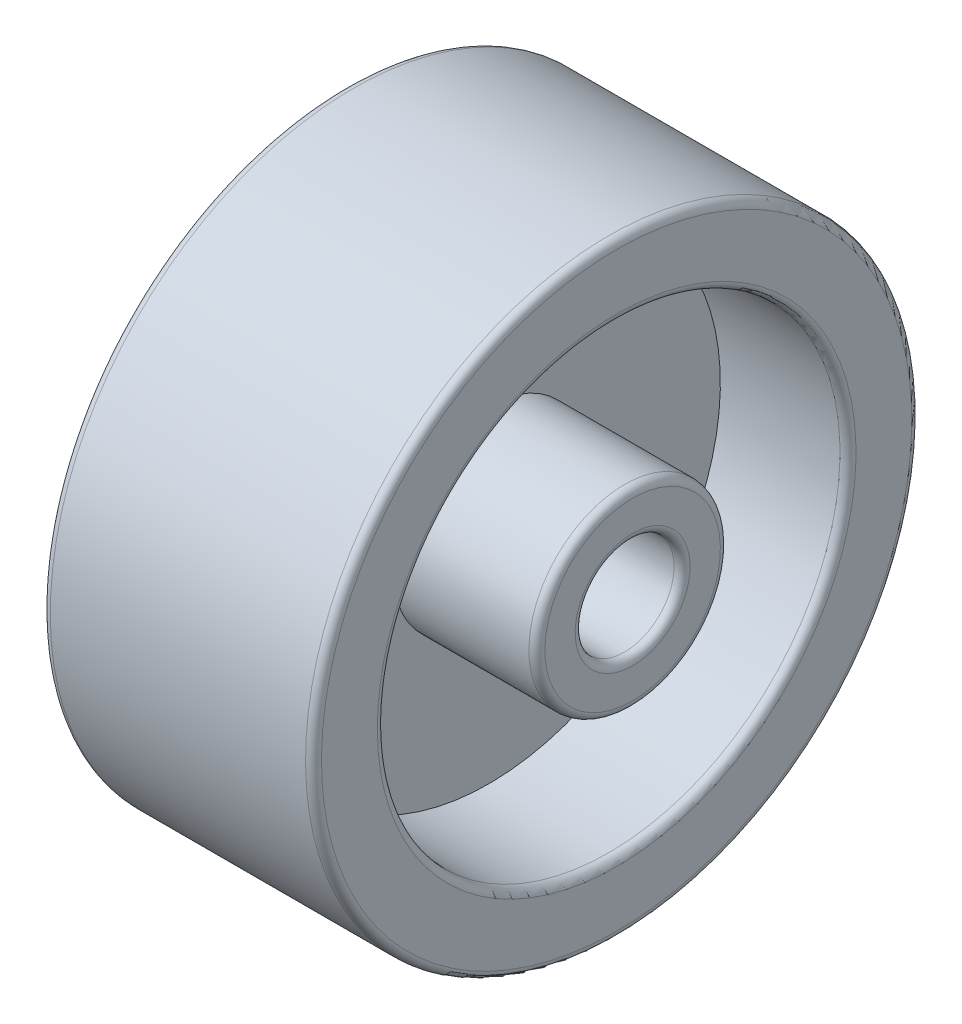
ISO-10303-21;
HEADER;
FILE_DESCRIPTION(('STEP AP214'),'2;1');
FILE_NAME('part.step','',(''),(''),'','','');
FILE_SCHEMA(('AUTOMOTIVE_DESIGN { 1 0 10303 214 1 1 1 1 }'));
ENDSEC;
DATA;
#1=APPLICATION_CONTEXT('core data for automotive mechanical design processes');
#2=APPLICATION_PROTOCOL_DEFINITION('international standard','automotive_design',2000,#1);
#3=PRODUCT_CONTEXT('',#1,'mechanical');
#4=PRODUCT('Part','Part','',(#3));
#5=PRODUCT_RELATED_PRODUCT_CATEGORY('part','',(#4));
#6=PRODUCT_DEFINITION_FORMATION('','',#4);
#7=PRODUCT_DEFINITION_CONTEXT('part definition',#1,'design');
#8=PRODUCT_DEFINITION('design','',#6,#7);
#9=PRODUCT_DEFINITION_SHAPE('','',#8);
#10=(LENGTH_UNIT() NAMED_UNIT(*) SI_UNIT(.MILLI.,.METRE.));
#11=(NAMED_UNIT(*) PLANE_ANGLE_UNIT() SI_UNIT($,.RADIAN.));
#12=(NAMED_UNIT(*) SI_UNIT($,.STERADIAN.) SOLID_ANGLE_UNIT());
#13=UNCERTAINTY_MEASURE_WITH_UNIT(LENGTH_MEASURE(1.E-05),#10,'distance_accuracy_value','');
#14=(GEOMETRIC_REPRESENTATION_CONTEXT(3) GLOBAL_UNCERTAINTY_ASSIGNED_CONTEXT((#13)) GLOBAL_UNIT_ASSIGNED_CONTEXT((#10,
#11,#12)) REPRESENTATION_CONTEXT('',''));
#15=CARTESIAN_POINT('',(0.,0.,0.));
#16=DIRECTION('',(0.,0.,1.));
#17=DIRECTION('',(1.,0.,0.));
#18=AXIS2_PLACEMENT_3D('',#15,#16,#17);
#19=CARTESIAN_POINT('',(-266.908011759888,1159.35472436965,32.));
#20=DIRECTION('',(1.,0.,0.));
#21=DIRECTION('',(0.,-0.55664943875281,-0.830747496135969));
#22=AXIS2_PLACEMENT_3D('',#19,#20,#21);
#23=TOROIDAL_SURFACE('',#22,18.5,0.5);
#24=CARTESIAN_POINT('',(-266.408011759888,1159.35472436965,32.));
#25=DIRECTION('',(1.,0.,0.));
#26=DIRECTION('',(0.,-0.55664943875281,-0.830747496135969));
#27=AXIS2_PLACEMENT_3D('',#24,#25,#26);
#28=CIRCLE('',#27,18.5);
#29=CARTESIAN_POINT('',(-266.408011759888,1149.05670975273,16.6311713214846));
#30=VERTEX_POINT('',#29);
#31=EDGE_CURVE('E78',#30,#30,#28,.T.);
#32=ORIENTED_EDGE('',*,*,#31,.F.);
#33=EDGE_LOOP('',(#32));
#34=FACE_BOUND('',#33,.T.);
#35=CARTESIAN_POINT('',(-266.908011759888,1159.35472436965,32.));
#36=DIRECTION('',(1.,0.,0.));
#37=DIRECTION('',(0.,-0.55664943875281,-0.830747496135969));
#38=AXIS2_PLACEMENT_3D('',#35,#36,#37);
#39=CIRCLE('',#38,19.);
#40=CARTESIAN_POINT('',(-266.908011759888,1148.77838503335,16.2157975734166));
#41=VERTEX_POINT('',#40);
#42=EDGE_CURVE('E10',#41,#41,#39,.T.);
#43=ORIENTED_EDGE('',*,*,#42,.T.);
#44=EDGE_LOOP('',(#43));
#45=FACE_BOUND('',#44,.T.);
#46=ADVANCED_FACE('F14',(#34,#45),#23,.T.);
#47=CARTESIAN_POINT('',(-162.602134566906,1159.35472436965,32.));
#48=DIRECTION('',(1.,0.,0.));
#49=DIRECTION('',(0.,-0.55664943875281,-0.830747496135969));
#50=AXIS2_PLACEMENT_3D('',#47,#48,#49);
#51=CYLINDRICAL_SURFACE('',#50,19.);
#52=ORIENTED_EDGE('',*,*,#42,.F.);
#53=EDGE_LOOP('',(#52));
#54=FACE_BOUND('',#53,.T.);
#55=CARTESIAN_POINT('',(-282.908011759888,1159.35472436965,32.));
#56=DIRECTION('',(1.,0.,0.));
#57=DIRECTION('',(0.,-0.55664943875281,-0.830747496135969));
#58=AXIS2_PLACEMENT_3D('',#55,#56,#57);
#59=CIRCLE('',#58,19.);
#60=CARTESIAN_POINT('',(-282.908011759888,1148.77838503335,16.2157975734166));
#61=VERTEX_POINT('',#60);
#62=EDGE_CURVE('E20',#61,#61,#59,.T.);
#63=ORIENTED_EDGE('',*,*,#62,.T.);
#64=EDGE_LOOP('',(#63));
#65=FACE_BOUND('',#64,.T.);
#66=ADVANCED_FACE('F85',(#54,#65),#51,.T.);
#67=CARTESIAN_POINT('',(-282.908011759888,1159.35472436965,32.));
#68=DIRECTION('',(1.,0.,0.));
#69=DIRECTION('',(0.,-0.55664943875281,-0.830747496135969));
#70=AXIS2_PLACEMENT_3D('',#67,#68,#69);
#71=TOROIDAL_SURFACE('',#70,18.5,0.5);
#72=ORIENTED_EDGE('',*,*,#62,.F.);
#73=EDGE_LOOP('',(#72));
#74=FACE_BOUND('',#73,.T.);
#75=CARTESIAN_POINT('',(-283.408011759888,1159.35472436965,32.));
#76=DIRECTION('',(1.,0.,0.));
#77=DIRECTION('',(0.,-0.55664943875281,-0.830747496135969));
#78=AXIS2_PLACEMENT_3D('',#75,#76,#77);
#79=CIRCLE('',#78,18.5);
#80=CARTESIAN_POINT('',(-283.408011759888,1149.05670975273,16.6311713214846));
#81=VERTEX_POINT('',#80);
#82=EDGE_CURVE('E24',#81,#81,#79,.T.);
#83=ORIENTED_EDGE('',*,*,#82,.T.);
#84=EDGE_LOOP('',(#83));
#85=FACE_BOUND('',#84,.T.);
#86=ADVANCED_FACE('F91',(#74,#85),#71,.T.);
#87=CARTESIAN_POINT('',(-283.408011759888,1174.72355304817,21.7019853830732));
#88=DIRECTION('',(1.,0.,0.));
#89=DIRECTION('',(0.,-0.55664943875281,-0.830747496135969));
#90=AXIS2_PLACEMENT_3D('',#87,#88,#89);
#91=PLANE('',#90);
#92=ORIENTED_EDGE('',*,*,#82,.F.);
#93=EDGE_LOOP('',(#92));
#94=FACE_BOUND('',#93,.T.);
#95=CARTESIAN_POINT('',(-283.408011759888,1159.35472436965,32.));
#96=DIRECTION('',(1.,0.,0.));
#97=DIRECTION('',(0.,-0.55664943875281,-0.830747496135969));
#98=AXIS2_PLACEMENT_3D('',#95,#96,#97);
#99=CIRCLE('',#98,15.);
#100=CARTESIAN_POINT('',(-283.408011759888,1151.00498278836,19.5387875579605));
#101=VERTEX_POINT('',#100);
#102=EDGE_CURVE('E28',#101,#101,#99,.T.);
#103=ORIENTED_EDGE('',*,*,#102,.T.);
#104=EDGE_LOOP('',(#103));
#105=FACE_BOUND('',#104,.T.);
#106=ADVANCED_FACE('F97',(#94,#105),#91,.F.);
#107=CARTESIAN_POINT('',(-282.908011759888,1159.35472436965,32.));
#108=DIRECTION('',(1.,0.,0.));
#109=DIRECTION('',(0.,-0.55664943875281,-0.830747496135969));
#110=AXIS2_PLACEMENT_3D('',#107,#108,#109);
#111=TOROIDAL_SURFACE('',#110,15.,0.5);
#112=ORIENTED_EDGE('',*,*,#102,.F.);
#113=EDGE_LOOP('',(#112));
#114=FACE_BOUND('',#113,.T.);
#115=CARTESIAN_POINT('',(-282.908011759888,1159.35472436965,32.));
#116=DIRECTION('',(1.,0.,0.));
#117=DIRECTION('',(0.,-0.55664943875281,-0.830747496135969));
#118=AXIS2_PLACEMENT_3D('',#115,#116,#117);
#119=CIRCLE('',#118,14.5);
#120=CARTESIAN_POINT('',(-282.908011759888,1151.28330750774,19.9541613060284));
#121=VERTEX_POINT('',#120);
#122=EDGE_CURVE('E33',#121,#121,#119,.T.);
#123=ORIENTED_EDGE('',*,*,#122,.T.);
#124=EDGE_LOOP('',(#123));
#125=FACE_BOUND('',#124,.T.);
#126=ADVANCED_FACE('F103',(#114,#125),#111,.T.);
#127=CARTESIAN_POINT('',(-162.602134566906,1159.35472436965,32.));
#128=DIRECTION('',(1.,0.,0.));
#129=DIRECTION('',(0.,-0.55664943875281,-0.830747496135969));
#130=AXIS2_PLACEMENT_3D('',#127,#128,#129);
#131=CYLINDRICAL_SURFACE('',#130,14.5);
#132=ORIENTED_EDGE('',*,*,#122,.F.);
#133=EDGE_LOOP('',(#132));
#134=FACE_BOUND('',#133,.T.);
#135=CARTESIAN_POINT('',(-275.408011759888,1159.35472436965,32.));
#136=DIRECTION('',(1.,0.,0.));
#137=DIRECTION('',(0.,-0.55664943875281,-0.830747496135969));
#138=AXIS2_PLACEMENT_3D('',#135,#136,#137);
#139=CIRCLE('',#138,14.5);
#140=CARTESIAN_POINT('',(-275.408011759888,1151.28330750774,19.9541613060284));
#141=VERTEX_POINT('',#140);
#142=EDGE_CURVE('E36',#141,#141,#139,.T.);
#143=ORIENTED_EDGE('',*,*,#142,.T.);
#144=EDGE_LOOP('',(#143));
#145=FACE_BOUND('',#144,.T.);
#146=ADVANCED_FACE('F107',(#134,#145),#131,.F.);
#147=CARTESIAN_POINT('',(-275.408011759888,1171.40056306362,23.9285831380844));
#148=DIRECTION('',(1.,0.,0.));
#149=DIRECTION('',(0.,-0.55664943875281,-0.830747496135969));
#150=AXIS2_PLACEMENT_3D('',#147,#148,#149);
#151=PLANE('',#150);
#152=ORIENTED_EDGE('',*,*,#142,.F.);
#153=EDGE_LOOP('',(#152));
#154=FACE_BOUND('',#153,.T.);
#155=CARTESIAN_POINT('',(-275.408011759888,1159.35472436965,32.));
#156=DIRECTION('',(1.,0.,0.));
#157=DIRECTION('',(0.,-0.55664943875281,-0.830747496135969));
#158=AXIS2_PLACEMENT_3D('',#155,#156,#157);
#159=CIRCLE('',#158,6.);
#160=CARTESIAN_POINT('',(-275.408011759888,1156.01482773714,27.0155150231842));
#161=VERTEX_POINT('',#160);
#162=EDGE_CURVE('E39',#161,#161,#159,.T.);
#163=ORIENTED_EDGE('',*,*,#162,.T.);
#164=EDGE_LOOP('',(#163));
#165=FACE_BOUND('',#164,.T.);
#166=ADVANCED_FACE('F111',(#154,#165),#151,.F.);
#167=CARTESIAN_POINT('',(-162.602134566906,1159.35472436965,32.));
#168=DIRECTION('',(1.,0.,0.));
#169=DIRECTION('',(0.,-0.55664943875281,-0.830747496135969));
#170=AXIS2_PLACEMENT_3D('',#167,#168,#169);
#171=CYLINDRICAL_SURFACE('',#170,6.);
#172=ORIENTED_EDGE('',*,*,#162,.F.);
#173=EDGE_LOOP('',(#172));
#174=FACE_BOUND('',#173,.T.);
#175=CARTESIAN_POINT('',(-283.908011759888,1159.35472436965,32.));
#176=DIRECTION('',(1.,0.,0.));
#177=DIRECTION('',(0.,-0.55664943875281,-0.830747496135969));
#178=AXIS2_PLACEMENT_3D('',#175,#176,#177);
#179=CIRCLE('',#178,6.);
#180=CARTESIAN_POINT('',(-283.908011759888,1156.01482773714,27.0155150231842));
#181=VERTEX_POINT('',#180);
#182=EDGE_CURVE('E42',#181,#181,#179,.T.);
#183=ORIENTED_EDGE('',*,*,#182,.T.);
#184=EDGE_LOOP('',(#183));
#185=FACE_BOUND('',#184,.T.);
#186=ADVANCED_FACE('F115',(#174,#185),#171,.T.);
#187=CARTESIAN_POINT('',(-283.908011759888,1159.35472436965,32.));
#188=DIRECTION('',(1.,0.,0.));
#189=DIRECTION('',(0.,-0.55664943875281,-0.830747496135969));
#190=AXIS2_PLACEMENT_3D('',#187,#188,#189);
#191=TOROIDAL_SURFACE('',#190,5.5,0.5);
#192=ORIENTED_EDGE('',*,*,#182,.F.);
#193=EDGE_LOOP('',(#192));
#194=FACE_BOUND('',#193,.T.);
#195=CARTESIAN_POINT('',(-284.408011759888,1159.35472436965,32.));
#196=DIRECTION('',(1.,0.,0.));
#197=DIRECTION('',(0.,-0.55664943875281,-0.830747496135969));
#198=AXIS2_PLACEMENT_3D('',#195,#196,#197);
#199=CIRCLE('',#198,5.5);
#200=CARTESIAN_POINT('',(-284.408011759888,1156.29315245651,27.4308887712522));
#201=VERTEX_POINT('',#200);
#202=EDGE_CURVE('E45',#201,#201,#199,.T.);
#203=ORIENTED_EDGE('',*,*,#202,.T.);
#204=EDGE_LOOP('',(#203));
#205=FACE_BOUND('',#204,.T.);
#206=ADVANCED_FACE('F119',(#194,#205),#191,.T.);
#207=CARTESIAN_POINT('',(-284.408011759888,1163.9238355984,28.9384280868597));
#208=DIRECTION('',(1.,0.,0.));
#209=DIRECTION('',(0.,-0.55664943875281,-0.830747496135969));
#210=AXIS2_PLACEMENT_3D('',#207,#208,#209);
#211=PLANE('',#210);
#212=ORIENTED_EDGE('',*,*,#202,.F.);
#213=EDGE_LOOP('',(#212));
#214=FACE_BOUND('',#213,.T.);
#215=CARTESIAN_POINT('',(-284.408011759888,1159.35472436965,32.));
#216=DIRECTION('',(1.,0.,0.));
#217=DIRECTION('',(0.,-0.55664943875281,-0.830747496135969));
#218=AXIS2_PLACEMENT_3D('',#215,#216,#217);
#219=CIRCLE('',#218,3.6);
#220=CARTESIAN_POINT('',(-284.408011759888,1157.35078639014,29.0093090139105));
#221=VERTEX_POINT('',#220);
#222=EDGE_CURVE('E48',#221,#221,#219,.T.);
#223=ORIENTED_EDGE('',*,*,#222,.T.);
#224=EDGE_LOOP('',(#223));
#225=FACE_BOUND('',#224,.T.);
#226=ADVANCED_FACE('F123',(#214,#225),#211,.F.);
#227=CARTESIAN_POINT('',(-283.908011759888,1159.35472436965,32.));
#228=DIRECTION('',(1.,0.,0.));
#229=DIRECTION('',(0.,-0.55664943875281,-0.830747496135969));
#230=AXIS2_PLACEMENT_3D('',#227,#228,#229);
#231=TOROIDAL_SURFACE('',#230,3.6,0.5);
#232=ORIENTED_EDGE('',*,*,#222,.F.);
#233=EDGE_LOOP('',(#232));
#234=FACE_BOUND('',#233,.T.);
#235=CARTESIAN_POINT('',(-283.908011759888,1159.35472436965,32.));
#236=DIRECTION('',(1.,0.,0.));
#237=DIRECTION('',(0.,-0.55664943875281,-0.830747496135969));
#238=AXIS2_PLACEMENT_3D('',#235,#236,#237);
#239=CIRCLE('',#238,3.1);
#240=CARTESIAN_POINT('',(-283.908011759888,1157.62911110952,29.4246827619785));
#241=VERTEX_POINT('',#240);
#242=EDGE_CURVE('E51',#241,#241,#239,.T.);
#243=ORIENTED_EDGE('',*,*,#242,.T.);
#244=EDGE_LOOP('',(#243));
#245=FACE_BOUND('',#244,.T.);
#246=ADVANCED_FACE('F127',(#234,#245),#231,.T.);
#247=CARTESIAN_POINT('',(-162.602134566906,1159.35472436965,32.));
#248=DIRECTION('',(1.,0.,0.));
#249=DIRECTION('',(0.,-0.55664943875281,-0.830747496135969));
#250=AXIS2_PLACEMENT_3D('',#247,#248,#249);
#251=CYLINDRICAL_SURFACE('',#250,3.1);
#252=ORIENTED_EDGE('',*,*,#242,.F.);
#253=EDGE_LOOP('',(#252));
#254=FACE_BOUND('',#253,.T.);
#255=CARTESIAN_POINT('',(-265.908011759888,1159.35472436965,32.));
#256=DIRECTION('',(1.,0.,0.));
#257=DIRECTION('',(0.,-0.55664943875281,-0.830747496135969));
#258=AXIS2_PLACEMENT_3D('',#255,#256,#257);
#259=CIRCLE('',#258,3.1);
#260=CARTESIAN_POINT('',(-265.908011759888,1157.62911110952,29.4246827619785));
#261=VERTEX_POINT('',#260);
#262=EDGE_CURVE('E54',#261,#261,#259,.T.);
#263=ORIENTED_EDGE('',*,*,#262,.T.);
#264=EDGE_LOOP('',(#263));
#265=FACE_BOUND('',#264,.T.);
#266=ADVANCED_FACE('F131',(#254,#265),#251,.F.);
#267=CARTESIAN_POINT('',(-265.908011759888,1159.35472436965,32.));
#268=DIRECTION('',(1.,0.,0.));
#269=DIRECTION('',(0.,-0.55664943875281,-0.830747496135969));
#270=AXIS2_PLACEMENT_3D('',#267,#268,#269);
#271=TOROIDAL_SURFACE('',#270,3.6,0.5);
#272=ORIENTED_EDGE('',*,*,#262,.F.);
#273=EDGE_LOOP('',(#272));
#274=FACE_BOUND('',#273,.T.);
#275=CARTESIAN_POINT('',(-265.408011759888,1159.35472436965,32.));
#276=DIRECTION('',(1.,0.,0.));
#277=DIRECTION('',(0.,-0.55664943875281,-0.830747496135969));
#278=AXIS2_PLACEMENT_3D('',#275,#276,#277);
#279=CIRCLE('',#278,3.6);
#280=CARTESIAN_POINT('',(-265.408011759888,1157.35078639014,29.0093090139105));
#281=VERTEX_POINT('',#280);
#282=EDGE_CURVE('E57',#281,#281,#279,.T.);
#283=ORIENTED_EDGE('',*,*,#282,.T.);
#284=EDGE_LOOP('',(#283));
#285=FACE_BOUND('',#284,.T.);
#286=ADVANCED_FACE('F135',(#274,#285),#271,.T.);
#287=CARTESIAN_POINT('',(-265.408011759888,1162.34541535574,29.99606202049));
#288=DIRECTION('',(-1.,0.,0.));
#289=DIRECTION('',(0.,0.55664943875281,0.830747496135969));
#290=AXIS2_PLACEMENT_3D('',#287,#288,#289);
#291=PLANE('',#290);
#292=ORIENTED_EDGE('',*,*,#282,.F.);
#293=EDGE_LOOP('',(#292));
#294=FACE_BOUND('',#293,.T.);
#295=CARTESIAN_POINT('',(-265.408011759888,1159.35472436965,32.));
#296=DIRECTION('',(1.,0.,0.));
#297=DIRECTION('',(0.,-0.55664943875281,-0.830747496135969));
#298=AXIS2_PLACEMENT_3D('',#295,#296,#297);
#299=CIRCLE('',#298,5.5);
#300=CARTESIAN_POINT('',(-265.408011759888,1156.29315245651,27.4308887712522));
#301=VERTEX_POINT('',#300);
#302=EDGE_CURVE('E60',#301,#301,#299,.T.);
#303=ORIENTED_EDGE('',*,*,#302,.T.);
#304=EDGE_LOOP('',(#303));
#305=FACE_BOUND('',#304,.T.);
#306=ADVANCED_FACE('F139',(#294,#305),#291,.F.);
#307=CARTESIAN_POINT('',(-265.908011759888,1159.35472436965,32.));
#308=DIRECTION('',(1.,0.,0.));
#309=DIRECTION('',(0.,-0.55664943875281,-0.830747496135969));
#310=AXIS2_PLACEMENT_3D('',#307,#308,#309);
#311=TOROIDAL_SURFACE('',#310,5.5,0.5);
#312=ORIENTED_EDGE('',*,*,#302,.F.);
#313=EDGE_LOOP('',(#312));
#314=FACE_BOUND('',#313,.T.);
#315=CARTESIAN_POINT('',(-265.908011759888,1159.35472436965,32.));
#316=DIRECTION('',(1.,0.,0.));
#317=DIRECTION('',(0.,-0.55664943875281,-0.830747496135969));
#318=AXIS2_PLACEMENT_3D('',#315,#316,#317);
#319=CIRCLE('',#318,6.);
#320=CARTESIAN_POINT('',(-265.908011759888,1156.01482773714,27.0155150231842));
#321=VERTEX_POINT('',#320);
#322=EDGE_CURVE('E63',#321,#321,#319,.T.);
#323=ORIENTED_EDGE('',*,*,#322,.T.);
#324=EDGE_LOOP('',(#323));
#325=FACE_BOUND('',#324,.T.);
#326=ADVANCED_FACE('F143',(#314,#325),#311,.T.);
#327=CARTESIAN_POINT('',(-162.602134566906,1159.35472436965,32.));
#328=DIRECTION('',(1.,0.,0.));
#329=DIRECTION('',(0.,-0.55664943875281,-0.830747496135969));
#330=AXIS2_PLACEMENT_3D('',#327,#328,#329);
#331=CYLINDRICAL_SURFACE('',#330,6.);
#332=ORIENTED_EDGE('',*,*,#322,.F.);
#333=EDGE_LOOP('',(#332));
#334=FACE_BOUND('',#333,.T.);
#335=CARTESIAN_POINT('',(-274.408011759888,1159.35472436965,32.));
#336=DIRECTION('',(1.,0.,0.));
#337=DIRECTION('',(0.,-0.55664943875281,-0.830747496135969));
#338=AXIS2_PLACEMENT_3D('',#335,#336,#337);
#339=CIRCLE('',#338,6.);
#340=CARTESIAN_POINT('',(-274.408011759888,1156.01482773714,27.0155150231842));
#341=VERTEX_POINT('',#340);
#342=EDGE_CURVE('E66',#341,#341,#339,.T.);
#343=ORIENTED_EDGE('',*,*,#342,.T.);
#344=EDGE_LOOP('',(#343));
#345=FACE_BOUND('',#344,.T.);
#346=ADVANCED_FACE('F147',(#334,#345),#331,.T.);
#347=CARTESIAN_POINT('',(-274.408011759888,1164.33920934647,28.6601033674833));
#348=DIRECTION('',(-1.,0.,0.));
#349=DIRECTION('',(0.,0.55664943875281,0.830747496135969));
#350=AXIS2_PLACEMENT_3D('',#347,#348,#349);
#351=PLANE('',#350);
#352=ORIENTED_EDGE('',*,*,#342,.F.);
#353=EDGE_LOOP('',(#352));
#354=FACE_BOUND('',#353,.T.);
#355=CARTESIAN_POINT('',(-274.408011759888,1159.35472436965,32.));
#356=DIRECTION('',(1.,0.,0.));
#357=DIRECTION('',(0.,-0.55664943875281,-0.830747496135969));
#358=AXIS2_PLACEMENT_3D('',#355,#356,#357);
#359=CIRCLE('',#358,14.5);
#360=CARTESIAN_POINT('',(-274.408011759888,1151.28330750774,19.9541613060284));
#361=VERTEX_POINT('',#360);
#362=EDGE_CURVE('E69',#361,#361,#359,.T.);
#363=ORIENTED_EDGE('',*,*,#362,.T.);
#364=EDGE_LOOP('',(#363));
#365=FACE_BOUND('',#364,.T.);
#366=ADVANCED_FACE('F151',(#354,#365),#351,.F.);
#367=CARTESIAN_POINT('',(-162.602134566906,1159.35472436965,32.));
#368=DIRECTION('',(1.,0.,0.));
#369=DIRECTION('',(0.,-0.55664943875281,-0.830747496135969));
#370=AXIS2_PLACEMENT_3D('',#367,#368,#369);
#371=CYLINDRICAL_SURFACE('',#370,14.5);
#372=ORIENTED_EDGE('',*,*,#362,.F.);
#373=EDGE_LOOP('',(#372));
#374=FACE_BOUND('',#373,.T.);
#375=CARTESIAN_POINT('',(-266.908011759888,1159.35472436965,32.));
#376=DIRECTION('',(1.,0.,0.));
#377=DIRECTION('',(0.,-0.55664943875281,-0.830747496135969));
#378=AXIS2_PLACEMENT_3D('',#375,#376,#377);
#379=CIRCLE('',#378,14.5);
#380=CARTESIAN_POINT('',(-266.908011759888,1151.28330750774,19.9541613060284));
#381=VERTEX_POINT('',#380);
#382=EDGE_CURVE('E72',#381,#381,#379,.T.);
#383=ORIENTED_EDGE('',*,*,#382,.T.);
#384=EDGE_LOOP('',(#383));
#385=FACE_BOUND('',#384,.T.);
#386=ADVANCED_FACE('F155',(#374,#385),#371,.F.);
#387=CARTESIAN_POINT('',(-266.908011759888,1159.35472436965,32.));
#388=DIRECTION('',(1.,0.,0.));
#389=DIRECTION('',(0.,-0.55664943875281,-0.830747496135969));
#390=AXIS2_PLACEMENT_3D('',#387,#388,#389);
#391=TOROIDAL_SURFACE('',#390,15.,0.5);
#392=ORIENTED_EDGE('',*,*,#382,.F.);
#393=EDGE_LOOP('',(#392));
#394=FACE_BOUND('',#393,.T.);
#395=CARTESIAN_POINT('',(-266.408011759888,1159.35472436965,32.));
#396=DIRECTION('',(1.,0.,0.));
#397=DIRECTION('',(0.,-0.55664943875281,-0.830747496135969));
#398=AXIS2_PLACEMENT_3D('',#395,#396,#397);
#399=CIRCLE('',#398,15.);
#400=CARTESIAN_POINT('',(-266.408011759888,1151.00498278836,19.5387875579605));
#401=VERTEX_POINT('',#400);
#402=EDGE_CURVE('E75',#401,#401,#399,.T.);
#403=ORIENTED_EDGE('',*,*,#402,.T.);
#404=EDGE_LOOP('',(#403));
#405=FACE_BOUND('',#404,.T.);
#406=ADVANCED_FACE('F159',(#394,#405),#391,.T.);
#407=CARTESIAN_POINT('',(-266.408011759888,1171.81593681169,23.6502584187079));
#408=DIRECTION('',(-1.,0.,0.));
#409=DIRECTION('',(0.,0.55664943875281,0.830747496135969));
#410=AXIS2_PLACEMENT_3D('',#407,#408,#409);
#411=PLANE('',#410);
#412=ORIENTED_EDGE('',*,*,#402,.F.);
#413=EDGE_LOOP('',(#412));
#414=FACE_BOUND('',#413,.T.);
#415=ORIENTED_EDGE('',*,*,#31,.T.);
#416=EDGE_LOOP('',(#415));
#417=FACE_BOUND('',#416,.T.);
#418=ADVANCED_FACE('F82',(#414,#417),#411,.F.);
#419=CLOSED_SHELL('',(#46,#66,#86,#106,#126,#146,#166,#186,#206,#226,#246,#266,#286,#306,#326,
#346,#366,#386,#406,#418));
#420=MANIFOLD_SOLID_BREP('B1',#419);
#421=ADVANCED_BREP_SHAPE_REPRESENTATION('',(#18,#420),#14);
#422=SHAPE_DEFINITION_REPRESENTATION(#9,#421);
ENDSEC;
END-ISO-10303-21;
